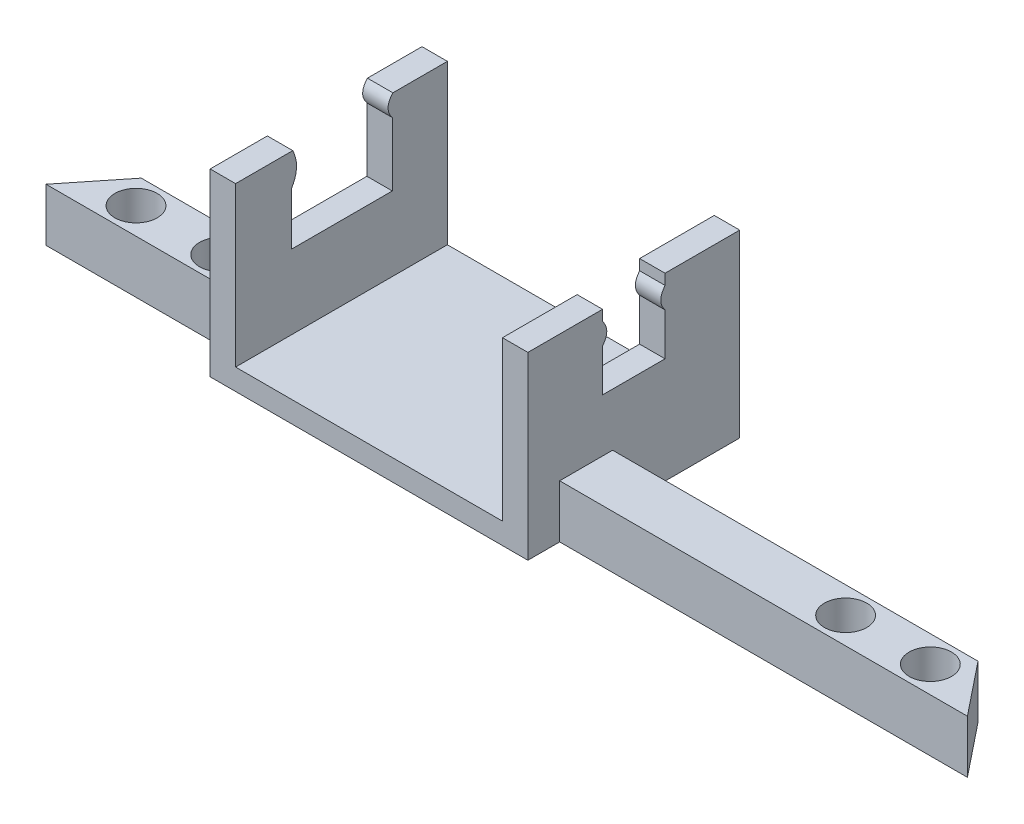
ISO-10303-21;
HEADER;
FILE_DESCRIPTION(('STEP AP214'),'2;1');
FILE_NAME('part.step','',(''),(''),'','','');
FILE_SCHEMA(('AUTOMOTIVE_DESIGN { 1 0 10303 214 1 1 1 1 }'));
ENDSEC;
DATA;
#1=APPLICATION_CONTEXT('core data for automotive mechanical design processes');
#2=APPLICATION_PROTOCOL_DEFINITION('international standard','automotive_design',2000,#1);
#3=PRODUCT_CONTEXT('',#1,'mechanical');
#4=PRODUCT('Part','Part','',(#3));
#5=PRODUCT_RELATED_PRODUCT_CATEGORY('part','',(#4));
#6=PRODUCT_DEFINITION_FORMATION('','',#4);
#7=PRODUCT_DEFINITION_CONTEXT('part definition',#1,'design');
#8=PRODUCT_DEFINITION('design','',#6,#7);
#9=PRODUCT_DEFINITION_SHAPE('','',#8);
#10=(LENGTH_UNIT() NAMED_UNIT(*) SI_UNIT(.MILLI.,.METRE.));
#11=(NAMED_UNIT(*) PLANE_ANGLE_UNIT() SI_UNIT($,.RADIAN.));
#12=(NAMED_UNIT(*) SI_UNIT($,.STERADIAN.) SOLID_ANGLE_UNIT());
#13=UNCERTAINTY_MEASURE_WITH_UNIT(LENGTH_MEASURE(1.E-05),#10,'distance_accuracy_value','');
#14=(GEOMETRIC_REPRESENTATION_CONTEXT(3) GLOBAL_UNCERTAINTY_ASSIGNED_CONTEXT((#13)) GLOBAL_UNIT_ASSIGNED_CONTEXT((#10,
#11,#12)) REPRESENTATION_CONTEXT('',''));
#15=CARTESIAN_POINT('',(0.,0.,0.));
#16=DIRECTION('',(0.,0.,1.));
#17=DIRECTION('',(1.,0.,0.));
#18=AXIS2_PLACEMENT_3D('',#15,#16,#17);
#19=CARTESIAN_POINT('',(-33.5,5.,7.));
#20=DIRECTION('',(0.,0.,1.));
#21=DIRECTION('',(1.,0.,0.));
#22=AXIS2_PLACEMENT_3D('',#19,#20,#21);
#23=PLANE('',#22);
#24=DIRECTION('',(-1.,0.,0.));
#25=VECTOR('',#24,1.);
#26=CARTESIAN_POINT('',(-33.5,5.,7.));
#27=LINE('',#26,#25);
#28=CARTESIAN_POINT('',(53.5,5.,7.00000000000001));
#29=VERTEX_POINT('',#28);
#30=CARTESIAN_POINT('',(15.,5.,7.00000000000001));
#31=VERTEX_POINT('',#30);
#32=EDGE_CURVE('E254',#29,#31,#27,.T.);
#33=ORIENTED_EDGE('',*,*,#32,.T.);
#34=DIRECTION('',(0.,-1.,0.));
#35=VECTOR('',#34,1.);
#36=CARTESIAN_POINT('',(15.,5.,7.));
#37=LINE('',#36,#35);
#38=CARTESIAN_POINT('',(15.,0.,7.00000000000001));
#39=VERTEX_POINT('',#38);
#40=EDGE_CURVE('E323',#31,#39,#37,.T.);
#41=ORIENTED_EDGE('',*,*,#40,.T.);
#42=DIRECTION('',(-1.,0.,0.));
#43=VECTOR('',#42,1.);
#44=CARTESIAN_POINT('',(-33.5,0.,7.));
#45=LINE('',#44,#43);
#46=CARTESIAN_POINT('',(53.5,0.,7.00000000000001));
#47=VERTEX_POINT('',#46);
#48=EDGE_CURVE('E240',#47,#39,#45,.T.);
#49=ORIENTED_EDGE('',*,*,#48,.F.);
#50=DIRECTION('',(0.,-1.,0.));
#51=VECTOR('',#50,1.);
#52=CARTESIAN_POINT('',(53.5,5.,7.00000000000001));
#53=LINE('',#52,#51);
#54=EDGE_CURVE('E246',#29,#47,#53,.T.);
#55=ORIENTED_EDGE('',*,*,#54,.F.);
#56=EDGE_LOOP('',(#33,#41,#49,#55));
#57=FACE_BOUND('',#56,.T.);
#58=ADVANCED_FACE('F35',(#57),#23,.T.);
#59=CARTESIAN_POINT('',(-15.,0.,7.00000000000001));
#60=VERTEX_POINT('',#59);
#61=CARTESIAN_POINT('',(-33.5,0.,7.));
#62=VERTEX_POINT('',#61);
#63=EDGE_CURVE('E234',#60,#62,#45,.T.);
#64=ORIENTED_EDGE('',*,*,#63,.F.);
#65=DIRECTION('',(0.,1.,0.));
#66=VECTOR('',#65,1.);
#67=CARTESIAN_POINT('',(-15.,16.0093585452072,7.));
#68=LINE('',#67,#66);
#69=CARTESIAN_POINT('',(-15.,5.,7.00000000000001));
#70=VERTEX_POINT('',#69);
#71=EDGE_CURVE('E11',#60,#70,#68,.T.);
#72=ORIENTED_EDGE('',*,*,#71,.T.);
#73=CARTESIAN_POINT('',(-33.5,5.,7.));
#74=VERTEX_POINT('',#73);
#75=EDGE_CURVE('E356',#70,#74,#27,.T.);
#76=ORIENTED_EDGE('',*,*,#75,.T.);
#77=DIRECTION('',(0.,-1.,0.));
#78=VECTOR('',#77,1.);
#79=CARTESIAN_POINT('',(-33.5,5.,7.));
#80=LINE('',#79,#78);
#81=EDGE_CURVE('E157',#74,#62,#80,.T.);
#82=ORIENTED_EDGE('',*,*,#81,.T.);
#83=EDGE_LOOP('',(#64,#72,#76,#82));
#84=FACE_BOUND('',#83,.T.);
#85=ADVANCED_FACE('F367',(#84),#23,.T.);
#86=CARTESIAN_POINT('',(-29.5,5.,2.));
#87=DIRECTION('',(0.,0.,-1.));
#88=DIRECTION('',(-1.,0.,0.));
#89=AXIS2_PLACEMENT_3D('',#86,#87,#88);
#90=PLANE('',#89);
#91=DIRECTION('',(1.,0.,0.));
#92=VECTOR('',#91,1.);
#93=CARTESIAN_POINT('',(-29.5,0.,2.));
#94=LINE('',#93,#92);
#95=CARTESIAN_POINT('',(15.,0.,2.));
#96=VERTEX_POINT('',#95);
#97=CARTESIAN_POINT('',(49.5,0.,2.00000000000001));
#98=VERTEX_POINT('',#97);
#99=EDGE_CURVE('E231',#96,#98,#94,.T.);
#100=ORIENTED_EDGE('',*,*,#99,.F.);
#101=DIRECTION('',(0.,1.,0.));
#102=VECTOR('',#101,1.);
#103=CARTESIAN_POINT('',(15.,5.,2.));
#104=LINE('',#103,#102);
#105=CARTESIAN_POINT('',(15.,5.,2.));
#106=VERTEX_POINT('',#105);
#107=EDGE_CURVE('E320',#96,#106,#104,.T.);
#108=ORIENTED_EDGE('',*,*,#107,.T.);
#109=DIRECTION('',(1.,0.,0.));
#110=VECTOR('',#109,1.);
#111=CARTESIAN_POINT('',(-29.5,5.,2.));
#112=LINE('',#111,#110);
#113=CARTESIAN_POINT('',(49.5,5.,2.00000000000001));
#114=VERTEX_POINT('',#113);
#115=EDGE_CURVE('E352',#106,#114,#112,.T.);
#116=ORIENTED_EDGE('',*,*,#115,.T.);
#117=DIRECTION('',(0.,-1.,0.));
#118=VECTOR('',#117,1.);
#119=CARTESIAN_POINT('',(49.5,5.,2.00000000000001));
#120=LINE('',#119,#118);
#121=EDGE_CURVE('E249',#114,#98,#120,.T.);
#122=ORIENTED_EDGE('',*,*,#121,.T.);
#123=EDGE_LOOP('',(#100,#108,#116,#122));
#124=FACE_BOUND('',#123,.T.);
#125=ADVANCED_FACE('F412',(#124),#90,.T.);
#126=DIRECTION('',(0.,-1.,0.));
#127=VECTOR('',#126,1.);
#128=CARTESIAN_POINT('',(-15.,16.0093585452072,2.));
#129=LINE('',#128,#127);
#130=CARTESIAN_POINT('',(-15.,5.,2.));
#131=VERTEX_POINT('',#130);
#132=CARTESIAN_POINT('',(-15.,0.,2.));
#133=VERTEX_POINT('',#132);
#134=EDGE_CURVE('E44',#131,#133,#129,.T.);
#135=ORIENTED_EDGE('',*,*,#134,.T.);
#136=CARTESIAN_POINT('',(-29.5,0.,2.));
#137=VERTEX_POINT('',#136);
#138=EDGE_CURVE('E207',#137,#133,#94,.T.);
#139=ORIENTED_EDGE('',*,*,#138,.F.);
#140=DIRECTION('',(0.,-1.,0.));
#141=VECTOR('',#140,1.);
#142=CARTESIAN_POINT('',(-29.5,5.,2.));
#143=LINE('',#142,#141);
#144=CARTESIAN_POINT('',(-29.5,5.,2.));
#145=VERTEX_POINT('',#144);
#146=EDGE_CURVE('E252',#145,#137,#143,.T.);
#147=ORIENTED_EDGE('',*,*,#146,.F.);
#148=EDGE_CURVE('E210',#145,#131,#112,.T.);
#149=ORIENTED_EDGE('',*,*,#148,.T.);
#150=EDGE_LOOP('',(#135,#139,#147,#149));
#151=FACE_BOUND('',#150,.T.);
#152=ADVANCED_FACE('F203',(#151),#90,.T.);
#153=CARTESIAN_POINT('',(0.,5.,0.));
#154=DIRECTION('',(0.,1.,0.));
#155=DIRECTION('',(0.,0.,1.));
#156=AXIS2_PLACEMENT_3D('',#153,#154,#155);
#157=PLANE('',#156);
#158=CARTESIAN_POINT('',(39.5,5.,4.5));
#159=DIRECTION('',(0.,-1.,0.));
#160=DIRECTION('',(0.,0.,-1.));
#161=AXIS2_PLACEMENT_3D('',#158,#159,#160);
#162=CIRCLE('',#161,2.);
#163=CARTESIAN_POINT('',(39.5,5.,2.5));
#164=VERTEX_POINT('',#163);
#165=EDGE_CURVE('E327',#164,#164,#162,.T.);
#166=ORIENTED_EDGE('',*,*,#165,.T.);
#167=EDGE_LOOP('',(#166));
#168=FACE_BOUND('',#167,.T.);
#169=CARTESIAN_POINT('',(47.5,5.,4.5));
#170=DIRECTION('',(0.,-1.,0.));
#171=DIRECTION('',(0.,0.,-1.));
#172=AXIS2_PLACEMENT_3D('',#169,#170,#171);
#173=CIRCLE('',#172,2.);
#174=CARTESIAN_POINT('',(47.5,5.,2.5));
#175=VERTEX_POINT('',#174);
#176=EDGE_CURVE('E339',#175,#175,#173,.T.);
#177=ORIENTED_EDGE('',*,*,#176,.T.);
#178=EDGE_LOOP('',(#177));
#179=FACE_BOUND('',#178,.T.);
#180=ORIENTED_EDGE('',*,*,#115,.F.);
#181=DIRECTION('',(0.,0.,1.));
#182=VECTOR('',#181,1.);
#183=CARTESIAN_POINT('',(15.,5.,0.));
#184=LINE('',#183,#182);
#185=EDGE_CURVE('E317',#106,#31,#184,.T.);
#186=ORIENTED_EDGE('',*,*,#185,.T.);
#187=ORIENTED_EDGE('',*,*,#32,.F.);
#188=DIRECTION('',(0.624695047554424,0.,0.780868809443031));
#189=VECTOR('',#188,1.);
#190=CARTESIAN_POINT('',(49.5,5.,2.00000000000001));
#191=LINE('',#190,#189);
#192=EDGE_CURVE('E354',#114,#29,#191,.T.);
#193=ORIENTED_EDGE('',*,*,#192,.F.);
#194=EDGE_LOOP('',(#180,#186,#187,#193));
#195=FACE_BOUND('',#194,.T.);
#196=ADVANCED_FACE('F409',(#168,#179,#195),#157,.T.);
#197=CARTESIAN_POINT('',(-12.6,15.0006250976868,-4.80000000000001));
#198=CARTESIAN_POINT('',(-12.6,16.0184045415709,-3.97537194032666));
#199=CARTESIAN_POINT('',(-12.6,17.,-4.85000000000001));
#200=B_SPLINE_CURVE_WITH_KNOTS('',2,(#197,#198,#199),.UNSPECIFIED.,.F.,.F.,(3,3),(0.,1.),.UNSPECIFIED.);
#201=DIRECTION('',(-1.,0.,0.));
#202=VECTOR('',#201,1.);
#203=SURFACE_OF_LINEAR_EXTRUSION('',#200,#202);
#204=CARTESIAN_POINT('',(-15.,15.0006250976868,-4.80000000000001));
#205=CARTESIAN_POINT('',(-15.,16.0184045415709,-3.97537194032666));
#206=CARTESIAN_POINT('',(-15.,17.,-4.85000000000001));
#207=B_SPLINE_CURVE_WITH_KNOTS('',2,(#204,#205,#206),.UNSPECIFIED.,.F.,.F.,(3,3),(0.,1.),.UNSPECIFIED.);
#208=CARTESIAN_POINT('',(-15.,15.0006250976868,-4.80000000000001));
#209=VERTEX_POINT('',#208);
#210=CARTESIAN_POINT('',(-15.,17.,-4.85000000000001));
#211=VERTEX_POINT('',#210);
#212=EDGE_CURVE('E151',#209,#211,#207,.T.);
#213=ORIENTED_EDGE('',*,*,#212,.F.);
#214=DIRECTION('',(-1.,0.,0.));
#215=VECTOR('',#214,1.);
#216=CARTESIAN_POINT('',(-12.6,15.0006250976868,-4.80000000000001));
#217=LINE('',#216,#215);
#218=CARTESIAN_POINT('',(-12.6,15.0006250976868,-4.80000000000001));
#219=VERTEX_POINT('',#218);
#220=EDGE_CURVE('E59',#219,#209,#217,.T.);
#221=ORIENTED_EDGE('',*,*,#220,.F.);
#222=CARTESIAN_POINT('',(-12.6,17.,-4.85000000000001));
#223=VERTEX_POINT('',#222);
#224=EDGE_CURVE('E186',#219,#223,#200,.T.);
#225=ORIENTED_EDGE('',*,*,#224,.T.);
#226=DIRECTION('',(-1.,0.,0.));
#227=VECTOR('',#226,1.);
#228=CARTESIAN_POINT('',(-12.6,17.,-4.85000000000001));
#229=LINE('',#228,#227);
#230=EDGE_CURVE('E98',#223,#211,#229,.T.);
#231=ORIENTED_EDGE('',*,*,#230,.T.);
#232=EDGE_LOOP('',(#213,#221,#225,#231));
#233=FACE_BOUND('',#232,.T.);
#234=ADVANCED_FACE('F37',(#233),#203,.T.);
#235=CARTESIAN_POINT('',(-12.6,15.0006250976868,-4.80000000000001));
#236=DIRECTION('',(0.,0.,1.));
#237=DIRECTION('',(1.,0.,0.));
#238=AXIS2_PLACEMENT_3D('',#235,#236,#237);
#239=PLANE('',#238);
#240=DIRECTION('',(0.,1.,0.));
#241=VECTOR('',#240,1.);
#242=CARTESIAN_POINT('',(-15.,15.0006250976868,-4.80000000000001));
#243=LINE('',#242,#241);
#244=CARTESIAN_POINT('',(-15.,9.00015625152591,-4.80000000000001));
#245=VERTEX_POINT('',#244);
#246=EDGE_CURVE('E183',#245,#209,#243,.T.);
#247=ORIENTED_EDGE('',*,*,#246,.F.);
#248=DIRECTION('',(-1.,0.,0.));
#249=VECTOR('',#248,1.);
#250=CARTESIAN_POINT('',(-12.6,9.00015625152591,-4.80000000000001));
#251=LINE('',#250,#249);
#252=CARTESIAN_POINT('',(-12.6,9.00015625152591,-4.80000000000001));
#253=VERTEX_POINT('',#252);
#254=EDGE_CURVE('E128',#253,#245,#251,.T.);
#255=ORIENTED_EDGE('',*,*,#254,.F.);
#256=DIRECTION('',(0.,1.,0.));
#257=VECTOR('',#256,1.);
#258=CARTESIAN_POINT('',(-12.6,15.0006250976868,-4.80000000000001));
#259=LINE('',#258,#257);
#260=EDGE_CURVE('E138',#253,#219,#259,.T.);
#261=ORIENTED_EDGE('',*,*,#260,.T.);
#262=ORIENTED_EDGE('',*,*,#220,.T.);
#263=EDGE_LOOP('',(#247,#255,#261,#262));
#264=FACE_BOUND('',#263,.T.);
#265=ADVANCED_FACE('F642',(#264),#239,.T.);
#266=CARTESIAN_POINT('',(-12.6,9.00015625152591,-4.80000000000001));
#267=DIRECTION('',(0.,1.,0.));
#268=DIRECTION('',(0.,0.,1.));
#269=AXIS2_PLACEMENT_3D('',#266,#267,#268);
#270=PLANE('',#269);
#271=DIRECTION('',(0.,0.,-1.));
#272=VECTOR('',#271,1.);
#273=CARTESIAN_POINT('',(-15.,9.00015625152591,-4.80000000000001));
#274=LINE('',#273,#272);
#275=CARTESIAN_POINT('',(-15.,9.00015625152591,4.69999999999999));
#276=VERTEX_POINT('',#275);
#277=EDGE_CURVE('E123',#276,#245,#274,.T.);
#278=ORIENTED_EDGE('',*,*,#277,.F.);
#279=DIRECTION('',(-1.,0.,0.));
#280=VECTOR('',#279,1.);
#281=CARTESIAN_POINT('',(-12.6,9.00015625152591,4.69999999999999));
#282=LINE('',#281,#280);
#283=CARTESIAN_POINT('',(-12.6,9.00015625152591,4.69999999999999));
#284=VERTEX_POINT('',#283);
#285=EDGE_CURVE('E117',#284,#276,#282,.T.);
#286=ORIENTED_EDGE('',*,*,#285,.F.);
#287=DIRECTION('',(0.,0.,-1.));
#288=VECTOR('',#287,1.);
#289=CARTESIAN_POINT('',(-12.6,9.00015625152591,-4.80000000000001));
#290=LINE('',#289,#288);
#291=EDGE_CURVE('E120',#284,#253,#290,.T.);
#292=ORIENTED_EDGE('',*,*,#291,.T.);
#293=ORIENTED_EDGE('',*,*,#254,.T.);
#294=EDGE_LOOP('',(#278,#286,#292,#293));
#295=FACE_BOUND('',#294,.T.);
#296=ADVANCED_FACE('F119',(#295),#270,.T.);
#297=CARTESIAN_POINT('',(-12.6,9.00015625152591,4.69999999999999));
#298=DIRECTION('',(0.,0.,-1.));
#299=DIRECTION('',(0.,1.,0.));
#300=AXIS2_PLACEMENT_3D('',#297,#298,#299);
#301=PLANE('',#300);
#302=DIRECTION('',(0.,-1.,0.));
#303=VECTOR('',#302,1.);
#304=CARTESIAN_POINT('',(-15.,9.00015625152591,4.69999999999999));
#305=LINE('',#304,#303);
#306=CARTESIAN_POINT('',(-15.,14.,4.69999999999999));
#307=VERTEX_POINT('',#306);
#308=EDGE_CURVE('E177',#307,#276,#305,.T.);
#309=ORIENTED_EDGE('',*,*,#308,.F.);
#310=DIRECTION('',(-1.,0.,0.));
#311=VECTOR('',#310,1.);
#312=CARTESIAN_POINT('',(-12.6,14.,4.69999999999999));
#313=LINE('',#312,#311);
#314=CARTESIAN_POINT('',(-12.6,14.,4.69999999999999));
#315=VERTEX_POINT('',#314);
#316=EDGE_CURVE('E129',#315,#307,#313,.T.);
#317=ORIENTED_EDGE('',*,*,#316,.F.);
#318=DIRECTION('',(0.,-1.,0.));
#319=VECTOR('',#318,1.);
#320=CARTESIAN_POINT('',(-12.6,9.00015625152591,4.69999999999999));
#321=LINE('',#320,#319);
#322=EDGE_CURVE('E136',#315,#284,#321,.T.);
#323=ORIENTED_EDGE('',*,*,#322,.T.);
#324=ORIENTED_EDGE('',*,*,#285,.T.);
#325=EDGE_LOOP('',(#309,#317,#323,#324));
#326=FACE_BOUND('',#325,.T.);
#327=ADVANCED_FACE('F140',(#326),#301,.T.);
#328=CARTESIAN_POINT('',(-12.6,17.,4.6));
#329=CARTESIAN_POINT('',(-12.6,15.4063054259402,3.84457064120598));
#330=CARTESIAN_POINT('',(-12.6,14.,4.69999999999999));
#331=B_SPLINE_CURVE_WITH_KNOTS('',2,(#328,#329,#330),.UNSPECIFIED.,.F.,.F.,(3,3),(0.,1.),.UNSPECIFIED.);
#332=DIRECTION('',(-1.,0.,0.));
#333=VECTOR('',#332,1.);
#334=SURFACE_OF_LINEAR_EXTRUSION('',#331,#333);
#335=CARTESIAN_POINT('',(-15.,17.,4.6));
#336=CARTESIAN_POINT('',(-15.,15.4063054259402,3.84457064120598));
#337=CARTESIAN_POINT('',(-15.,14.,4.69999999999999));
#338=B_SPLINE_CURVE_WITH_KNOTS('',2,(#335,#336,#337),.UNSPECIFIED.,.F.,.F.,(3,3),(0.,1.),.UNSPECIFIED.);
#339=CARTESIAN_POINT('',(-15.,17.,4.6));
#340=VERTEX_POINT('',#339);
#341=EDGE_CURVE('E172',#340,#307,#338,.T.);
#342=ORIENTED_EDGE('',*,*,#341,.F.);
#343=DIRECTION('',(-1.,0.,0.));
#344=VECTOR('',#343,1.);
#345=CARTESIAN_POINT('',(-12.6,17.,4.6));
#346=LINE('',#345,#344);
#347=CARTESIAN_POINT('',(-12.6,17.,4.6));
#348=VERTEX_POINT('',#347);
#349=EDGE_CURVE('E190',#348,#340,#346,.T.);
#350=ORIENTED_EDGE('',*,*,#349,.F.);
#351=EDGE_CURVE('E141',#348,#315,#331,.T.);
#352=ORIENTED_EDGE('',*,*,#351,.T.);
#353=ORIENTED_EDGE('',*,*,#316,.T.);
#354=EDGE_LOOP('',(#342,#350,#352,#353));
#355=FACE_BOUND('',#354,.T.);
#356=ADVANCED_FACE('F892',(#355),#334,.T.);
#357=CARTESIAN_POINT('',(-12.6,17.,4.6));
#358=DIRECTION('',(0.,1.,0.));
#359=DIRECTION('',(0.,0.,1.));
#360=AXIS2_PLACEMENT_3D('',#357,#358,#359);
#361=PLANE('',#360);
#362=DIRECTION('',(0.,0.,-1.));
#363=VECTOR('',#362,1.);
#364=CARTESIAN_POINT('',(-15.,17.,4.6));
#365=LINE('',#364,#363);
#366=CARTESIAN_POINT('',(-15.,17.,10.));
#367=VERTEX_POINT('',#366);
#368=EDGE_CURVE('E169',#367,#340,#365,.T.);
#369=ORIENTED_EDGE('',*,*,#368,.F.);
#370=DIRECTION('',(-1.,0.,0.));
#371=VECTOR('',#370,1.);
#372=CARTESIAN_POINT('',(-12.6,17.,10.));
#373=LINE('',#372,#371);
#374=CARTESIAN_POINT('',(-12.6,17.,10.));
#375=VERTEX_POINT('',#374);
#376=EDGE_CURVE('E192',#375,#367,#373,.T.);
#377=ORIENTED_EDGE('',*,*,#376,.F.);
#378=DIRECTION('',(0.,0.,-1.));
#379=VECTOR('',#378,1.);
#380=CARTESIAN_POINT('',(-12.6,17.,4.6));
#381=LINE('',#380,#379);
#382=EDGE_CURVE('E143',#375,#348,#381,.T.);
#383=ORIENTED_EDGE('',*,*,#382,.T.);
#384=ORIENTED_EDGE('',*,*,#349,.T.);
#385=EDGE_LOOP('',(#369,#377,#383,#384));
#386=FACE_BOUND('',#385,.T.);
#387=ADVANCED_FACE('F276',(#386),#361,.T.);
#388=CARTESIAN_POINT('',(-12.6,2.,10.));
#389=DIRECTION('',(0.,0.,1.));
#390=DIRECTION('',(0.,-1.,0.));
#391=AXIS2_PLACEMENT_3D('',#388,#389,#390);
#392=PLANE('',#391);
#393=DIRECTION('',(0.,1.,0.));
#394=VECTOR('',#393,1.);
#395=CARTESIAN_POINT('',(-15.,2.,10.));
#396=LINE('',#395,#394);
#397=CARTESIAN_POINT('',(-15.,0.,10.));
#398=VERTEX_POINT('',#397);
#399=EDGE_CURVE('E166',#398,#367,#396,.T.);
#400=ORIENTED_EDGE('',*,*,#399,.F.);
#401=DIRECTION('',(1.,0.,0.));
#402=VECTOR('',#401,1.);
#403=CARTESIAN_POINT('',(-15.,0.,10.));
#404=LINE('',#403,#402);
#405=CARTESIAN_POINT('',(15.,0.,10.));
#406=VERTEX_POINT('',#405);
#407=EDGE_CURVE('E222',#398,#406,#404,.T.);
#408=ORIENTED_EDGE('',*,*,#407,.T.);
#409=DIRECTION('',(0.,-1.,0.));
#410=VECTOR('',#409,1.);
#411=CARTESIAN_POINT('',(15.,2.,10.));
#412=LINE('',#411,#410);
#413=CARTESIAN_POINT('',(15.,17.,10.));
#414=VERTEX_POINT('',#413);
#415=EDGE_CURVE('E297',#414,#406,#412,.T.);
#416=ORIENTED_EDGE('',*,*,#415,.F.);
#417=DIRECTION('',(1.,0.,0.));
#418=VECTOR('',#417,1.);
#419=CARTESIAN_POINT('',(12.6,17.,10.));
#420=LINE('',#419,#418);
#421=CARTESIAN_POINT('',(12.6,17.,10.));
#422=VERTEX_POINT('',#421);
#423=EDGE_CURVE('E453',#422,#414,#420,.T.);
#424=ORIENTED_EDGE('',*,*,#423,.F.);
#425=DIRECTION('',(0.,-1.,0.));
#426=VECTOR('',#425,1.);
#427=CARTESIAN_POINT('',(12.6,2.,10.));
#428=LINE('',#427,#426);
#429=CARTESIAN_POINT('',(12.6,2.,10.));
#430=VERTEX_POINT('',#429);
#431=EDGE_CURVE('E290',#422,#430,#428,.T.);
#432=ORIENTED_EDGE('',*,*,#431,.T.);
#433=DIRECTION('',(1.,0.,0.));
#434=VECTOR('',#433,1.);
#435=CARTESIAN_POINT('',(-15.,2.,10.));
#436=LINE('',#435,#434);
#437=CARTESIAN_POINT('',(-12.6,2.,10.));
#438=VERTEX_POINT('',#437);
#439=EDGE_CURVE('E286',#438,#430,#436,.T.);
#440=ORIENTED_EDGE('',*,*,#439,.F.);
#441=DIRECTION('',(0.,1.,0.));
#442=VECTOR('',#441,1.);
#443=CARTESIAN_POINT('',(-12.6,2.,10.));
#444=LINE('',#443,#442);
#445=EDGE_CURVE('E270',#438,#375,#444,.T.);
#446=ORIENTED_EDGE('',*,*,#445,.T.);
#447=ORIENTED_EDGE('',*,*,#376,.T.);
#448=EDGE_LOOP('',(#400,#408,#416,#424,#432,#440,#446,#447));
#449=FACE_BOUND('',#448,.T.);
#450=ADVANCED_FACE('F283',(#449),#392,.T.);
#451=CARTESIAN_POINT('',(-12.6,2.,-10.));
#452=DIRECTION('',(0.,0.,-1.));
#453=DIRECTION('',(0.,1.,0.));
#454=AXIS2_PLACEMENT_3D('',#451,#452,#453);
#455=PLANE('',#454);
#456=DIRECTION('',(0.,-1.,0.));
#457=VECTOR('',#456,1.);
#458=CARTESIAN_POINT('',(-15.,2.,-10.));
#459=LINE('',#458,#457);
#460=CARTESIAN_POINT('',(-15.,17.,-10.));
#461=VERTEX_POINT('',#460);
#462=CARTESIAN_POINT('',(-15.,0.,-10.));
#463=VERTEX_POINT('',#462);
#464=EDGE_CURVE('E163',#461,#463,#459,.T.);
#465=ORIENTED_EDGE('',*,*,#464,.F.);
#466=DIRECTION('',(-1.,0.,0.));
#467=VECTOR('',#466,1.);
#468=CARTESIAN_POINT('',(-12.6,17.,-10.));
#469=LINE('',#468,#467);
#470=CARTESIAN_POINT('',(-12.6,17.,-10.));
#471=VERTEX_POINT('',#470);
#472=EDGE_CURVE('E194',#471,#461,#469,.T.);
#473=ORIENTED_EDGE('',*,*,#472,.F.);
#474=DIRECTION('',(0.,-1.,0.));
#475=VECTOR('',#474,1.);
#476=CARTESIAN_POINT('',(-12.6,2.,-10.));
#477=LINE('',#476,#475);
#478=CARTESIAN_POINT('',(-12.6,2.,-10.));
#479=VERTEX_POINT('',#478);
#480=EDGE_CURVE('E264',#471,#479,#477,.T.);
#481=ORIENTED_EDGE('',*,*,#480,.T.);
#482=DIRECTION('',(-1.,0.,0.));
#483=VECTOR('',#482,1.);
#484=CARTESIAN_POINT('',(-15.,2.,-10.));
#485=LINE('',#484,#483);
#486=CARTESIAN_POINT('',(12.6,2.,-10.));
#487=VERTEX_POINT('',#486);
#488=EDGE_CURVE('E298',#487,#479,#485,.T.);
#489=ORIENTED_EDGE('',*,*,#488,.F.);
#490=DIRECTION('',(0.,1.,0.));
#491=VECTOR('',#490,1.);
#492=CARTESIAN_POINT('',(12.6,2.,-10.));
#493=LINE('',#492,#491);
#494=CARTESIAN_POINT('',(12.6,17.,-10.));
#495=VERTEX_POINT('',#494);
#496=EDGE_CURVE('E610',#487,#495,#493,.T.);
#497=ORIENTED_EDGE('',*,*,#496,.T.);
#498=DIRECTION('',(1.,0.,0.));
#499=VECTOR('',#498,1.);
#500=CARTESIAN_POINT('',(12.6,17.,-10.));
#501=LINE('',#500,#499);
#502=CARTESIAN_POINT('',(15.,17.,-10.));
#503=VERTEX_POINT('',#502);
#504=EDGE_CURVE('E450',#495,#503,#501,.T.);
#505=ORIENTED_EDGE('',*,*,#504,.T.);
#506=DIRECTION('',(0.,-1.,0.));
#507=VECTOR('',#506,1.);
#508=CARTESIAN_POINT('',(15.,2.,-10.));
#509=LINE('',#508,#507);
#510=CARTESIAN_POINT('',(15.,0.,-10.));
#511=VERTEX_POINT('',#510);
#512=EDGE_CURVE('E301',#503,#511,#509,.T.);
#513=ORIENTED_EDGE('',*,*,#512,.T.);
#514=DIRECTION('',(-1.,0.,0.));
#515=VECTOR('',#514,1.);
#516=CARTESIAN_POINT('',(-15.,0.,-10.));
#517=LINE('',#516,#515);
#518=EDGE_CURVE('E310',#511,#463,#517,.T.);
#519=ORIENTED_EDGE('',*,*,#518,.T.);
#520=EDGE_LOOP('',(#465,#473,#481,#489,#497,#505,#513,#519));
#521=FACE_BOUND('',#520,.T.);
#522=ADVANCED_FACE('F635',(#521),#455,.T.);
#523=CARTESIAN_POINT('',(-12.6,17.,-10.));
#524=DIRECTION('',(0.,1.,0.));
#525=DIRECTION('',(0.,0.,1.));
#526=AXIS2_PLACEMENT_3D('',#523,#524,#525);
#527=PLANE('',#526);
#528=DIRECTION('',(0.,0.,-1.));
#529=VECTOR('',#528,1.);
#530=CARTESIAN_POINT('',(-15.,17.,-10.));
#531=LINE('',#530,#529);
#532=EDGE_CURVE('E156',#211,#461,#531,.T.);
#533=ORIENTED_EDGE('',*,*,#532,.F.);
#534=ORIENTED_EDGE('',*,*,#230,.F.);
#535=DIRECTION('',(0.,0.,-1.));
#536=VECTOR('',#535,1.);
#537=CARTESIAN_POINT('',(-12.6,17.,-10.));
#538=LINE('',#537,#536);
#539=EDGE_CURVE('E259',#223,#471,#538,.T.);
#540=ORIENTED_EDGE('',*,*,#539,.T.);
#541=ORIENTED_EDGE('',*,*,#472,.T.);
#542=EDGE_LOOP('',(#533,#534,#540,#541));
#543=FACE_BOUND('',#542,.T.);
#544=ADVANCED_FACE('F641',(#543),#527,.T.);
#545=CARTESIAN_POINT('',(-12.6,16.0093585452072,-4.40018597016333));
#546=DIRECTION('',(-1.,0.,0.));
#547=DIRECTION('',(0.,0.,1.));
#548=AXIS2_PLACEMENT_3D('',#545,#546,#547);
#549=PLANE('',#548);
#550=ORIENTED_EDGE('',*,*,#445,.F.);
#551=DIRECTION('',(0.,0.,1.));
#552=VECTOR('',#551,1.);
#553=CARTESIAN_POINT('',(-12.6,2.,-10.));
#554=LINE('',#553,#552);
#555=EDGE_CURVE('E267',#479,#438,#554,.T.);
#556=ORIENTED_EDGE('',*,*,#555,.F.);
#557=ORIENTED_EDGE('',*,*,#480,.F.);
#558=ORIENTED_EDGE('',*,*,#539,.F.);
#559=ORIENTED_EDGE('',*,*,#224,.F.);
#560=ORIENTED_EDGE('',*,*,#260,.F.);
#561=ORIENTED_EDGE('',*,*,#291,.F.);
#562=ORIENTED_EDGE('',*,*,#322,.F.);
#563=ORIENTED_EDGE('',*,*,#351,.F.);
#564=ORIENTED_EDGE('',*,*,#382,.F.);
#565=EDGE_LOOP('',(#550,#556,#557,#558,#559,#560,#561,#562,#563,#564));
#566=FACE_BOUND('',#565,.T.);
#567=ADVANCED_FACE('F134',(#566),#549,.F.);
#568=CARTESIAN_POINT('',(-15.,16.0093585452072,-4.40018597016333));
#569=DIRECTION('',(-1.,0.,0.));
#570=DIRECTION('',(0.,0.,1.));
#571=AXIS2_PLACEMENT_3D('',#568,#569,#570);
#572=PLANE('',#571);
#573=ORIENTED_EDGE('',*,*,#71,.F.);
#574=DIRECTION('',(0.,0.,1.));
#575=VECTOR('',#574,1.);
#576=CARTESIAN_POINT('',(-15.,0.,-10.));
#577=LINE('',#576,#575);
#578=EDGE_CURVE('E223',#60,#398,#577,.T.);
#579=ORIENTED_EDGE('',*,*,#578,.T.);
#580=ORIENTED_EDGE('',*,*,#399,.T.);
#581=ORIENTED_EDGE('',*,*,#368,.T.);
#582=ORIENTED_EDGE('',*,*,#341,.T.);
#583=ORIENTED_EDGE('',*,*,#308,.T.);
#584=ORIENTED_EDGE('',*,*,#277,.T.);
#585=ORIENTED_EDGE('',*,*,#246,.T.);
#586=ORIENTED_EDGE('',*,*,#212,.T.);
#587=ORIENTED_EDGE('',*,*,#532,.T.);
#588=ORIENTED_EDGE('',*,*,#464,.T.);
#589=EDGE_CURVE('E215',#463,#133,#577,.T.);
#590=ORIENTED_EDGE('',*,*,#589,.T.);
#591=ORIENTED_EDGE('',*,*,#134,.F.);
#592=DIRECTION('',(0.,0.,-1.));
#593=VECTOR('',#592,1.);
#594=CARTESIAN_POINT('',(-15.,5.,-4.40018597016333));
#595=LINE('',#594,#593);
#596=EDGE_CURVE('E51',#70,#131,#595,.T.);
#597=ORIENTED_EDGE('',*,*,#596,.F.);
#598=EDGE_LOOP('',(#573,#579,#580,#581,#582,#583,#584,#585,#586,#587,#588,#590,#591,#597));
#599=FACE_BOUND('',#598,.T.);
#600=ADVANCED_FACE('F216',(#599),#572,.T.);
#601=CARTESIAN_POINT('',(-29.5,5.,2.));
#602=DIRECTION('',(-0.780868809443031,0.,-0.624695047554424));
#603=DIRECTION('',(-0.624695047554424,0.,0.780868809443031));
#604=AXIS2_PLACEMENT_3D('',#601,#602,#603);
#605=PLANE('',#604);
#606=DIRECTION('',(0.624695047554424,0.,-0.780868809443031));
#607=VECTOR('',#606,1.);
#608=CARTESIAN_POINT('',(-29.5,0.,2.));
#609=LINE('',#608,#607);
#610=EDGE_CURVE('E229',#62,#137,#609,.T.);
#611=ORIENTED_EDGE('',*,*,#610,.F.);
#612=ORIENTED_EDGE('',*,*,#81,.F.);
#613=DIRECTION('',(0.624695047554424,0.,-0.780868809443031));
#614=VECTOR('',#613,1.);
#615=CARTESIAN_POINT('',(-29.5,5.,2.));
#616=LINE('',#615,#614);
#617=EDGE_CURVE('E243',#74,#145,#616,.T.);
#618=ORIENTED_EDGE('',*,*,#617,.T.);
#619=ORIENTED_EDGE('',*,*,#146,.T.);
#620=EDGE_LOOP('',(#611,#612,#618,#619));
#621=FACE_BOUND('',#620,.T.);
#622=ADVANCED_FACE('F374',(#621),#605,.T.);
#623=CARTESIAN_POINT('',(49.5,5.,2.00000000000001));
#624=DIRECTION('',(0.780868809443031,0.,-0.624695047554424));
#625=DIRECTION('',(-0.624695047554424,0.,-0.780868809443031));
#626=AXIS2_PLACEMENT_3D('',#623,#624,#625);
#627=PLANE('',#626);
#628=DIRECTION('',(0.624695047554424,0.,0.780868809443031));
#629=VECTOR('',#628,1.);
#630=CARTESIAN_POINT('',(49.5,0.,2.00000000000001));
#631=LINE('',#630,#629);
#632=EDGE_CURVE('E230',#98,#47,#631,.T.);
#633=ORIENTED_EDGE('',*,*,#632,.F.);
#634=ORIENTED_EDGE('',*,*,#121,.F.);
#635=ORIENTED_EDGE('',*,*,#192,.T.);
#636=ORIENTED_EDGE('',*,*,#54,.T.);
#637=EDGE_LOOP('',(#633,#634,#635,#636));
#638=FACE_BOUND('',#637,.T.);
#639=ADVANCED_FACE('F390',(#638),#627,.T.);
#640=CARTESIAN_POINT('',(-19.5,5.,4.5));
#641=DIRECTION('',(0.,-1.,0.));
#642=DIRECTION('',(0.,0.,-1.));
#643=AXIS2_PLACEMENT_3D('',#640,#641,#642);
#644=CIRCLE('',#643,2.);
#645=CARTESIAN_POINT('',(-19.5,5.,2.5));
#646=VERTEX_POINT('',#645);
#647=EDGE_CURVE('E333',#646,#646,#644,.T.);
#648=ORIENTED_EDGE('',*,*,#647,.T.);
#649=EDGE_LOOP('',(#648));
#650=FACE_BOUND('',#649,.T.);
#651=CARTESIAN_POINT('',(-27.5,5.,4.5));
#652=DIRECTION('',(0.,-1.,0.));
#653=DIRECTION('',(0.,0.,-1.));
#654=AXIS2_PLACEMENT_3D('',#651,#652,#653);
#655=CIRCLE('',#654,2.);
#656=CARTESIAN_POINT('',(-27.5,5.,2.5));
#657=VERTEX_POINT('',#656);
#658=EDGE_CURVE('E345',#657,#657,#655,.T.);
#659=ORIENTED_EDGE('',*,*,#658,.T.);
#660=EDGE_LOOP('',(#659));
#661=FACE_BOUND('',#660,.T.);
#662=ORIENTED_EDGE('',*,*,#75,.F.);
#663=ORIENTED_EDGE('',*,*,#596,.T.);
#664=ORIENTED_EDGE('',*,*,#148,.F.);
#665=ORIENTED_EDGE('',*,*,#617,.F.);
#666=EDGE_LOOP('',(#662,#663,#664,#665));
#667=FACE_BOUND('',#666,.T.);
#668=ADVANCED_FACE('F376',(#650,#661,#667),#157,.T.);
#669=CARTESIAN_POINT('',(0.,0.,0.));
#670=DIRECTION('',(0.,1.,0.));
#671=DIRECTION('',(0.,0.,1.));
#672=AXIS2_PLACEMENT_3D('',#669,#670,#671);
#673=PLANE('',#672);
#674=ORIENTED_EDGE('',*,*,#138,.T.);
#675=ORIENTED_EDGE('',*,*,#589,.F.);
#676=ORIENTED_EDGE('',*,*,#518,.F.);
#677=DIRECTION('',(0.,0.,-1.));
#678=VECTOR('',#677,1.);
#679=CARTESIAN_POINT('',(15.,0.,-10.));
#680=LINE('',#679,#678);
#681=EDGE_CURVE('E311',#96,#511,#680,.T.);
#682=ORIENTED_EDGE('',*,*,#681,.F.);
#683=ORIENTED_EDGE('',*,*,#99,.T.);
#684=ORIENTED_EDGE('',*,*,#632,.T.);
#685=ORIENTED_EDGE('',*,*,#48,.T.);
#686=EDGE_CURVE('E307',#406,#39,#680,.T.);
#687=ORIENTED_EDGE('',*,*,#686,.F.);
#688=ORIENTED_EDGE('',*,*,#407,.F.);
#689=ORIENTED_EDGE('',*,*,#578,.F.);
#690=ORIENTED_EDGE('',*,*,#63,.T.);
#691=ORIENTED_EDGE('',*,*,#610,.T.);
#692=EDGE_LOOP('',(#674,#675,#676,#682,#683,#684,#685,#687,#688,#689,#690,#691));
#693=FACE_BOUND('',#692,.T.);
#694=CARTESIAN_POINT('',(-27.5,0.,4.5));
#695=DIRECTION('',(0.,-1.,0.));
#696=DIRECTION('',(0.,0.,-1.));
#697=AXIS2_PLACEMENT_3D('',#694,#695,#696);
#698=CIRCLE('',#697,2.);
#699=CARTESIAN_POINT('',(-27.5,0.,2.5));
#700=VERTEX_POINT('',#699);
#701=EDGE_CURVE('E342',#700,#700,#698,.T.);
#702=ORIENTED_EDGE('',*,*,#701,.F.);
#703=EDGE_LOOP('',(#702));
#704=FACE_BOUND('',#703,.T.);
#705=CARTESIAN_POINT('',(-19.5,0.,4.5));
#706=DIRECTION('',(0.,-1.,0.));
#707=DIRECTION('',(0.,0.,-1.));
#708=AXIS2_PLACEMENT_3D('',#705,#706,#707);
#709=CIRCLE('',#708,2.);
#710=CARTESIAN_POINT('',(-19.5,0.,2.5));
#711=VERTEX_POINT('',#710);
#712=EDGE_CURVE('E330',#711,#711,#709,.T.);
#713=ORIENTED_EDGE('',*,*,#712,.F.);
#714=EDGE_LOOP('',(#713));
#715=FACE_BOUND('',#714,.T.);
#716=CARTESIAN_POINT('',(47.5,0.,4.5));
#717=DIRECTION('',(0.,-1.,0.));
#718=DIRECTION('',(0.,0.,-1.));
#719=AXIS2_PLACEMENT_3D('',#716,#717,#718);
#720=CIRCLE('',#719,2.);
#721=CARTESIAN_POINT('',(47.5,0.,2.5));
#722=VERTEX_POINT('',#721);
#723=EDGE_CURVE('E336',#722,#722,#720,.T.);
#724=ORIENTED_EDGE('',*,*,#723,.F.);
#725=EDGE_LOOP('',(#724));
#726=FACE_BOUND('',#725,.T.);
#727=CARTESIAN_POINT('',(39.5,0.,4.5));
#728=DIRECTION('',(0.,-1.,0.));
#729=DIRECTION('',(0.,0.,-1.));
#730=AXIS2_PLACEMENT_3D('',#727,#728,#729);
#731=CIRCLE('',#730,2.);
#732=CARTESIAN_POINT('',(39.5,0.,2.5));
#733=VERTEX_POINT('',#732);
#734=EDGE_CURVE('E326',#733,#733,#731,.T.);
#735=ORIENTED_EDGE('',*,*,#734,.F.);
#736=EDGE_LOOP('',(#735));
#737=FACE_BOUND('',#736,.T.);
#738=ADVANCED_FACE('F225',(#693,#704,#715,#726,#737),#673,.F.);
#739=CARTESIAN_POINT('',(-27.5,5.,4.5));
#740=DIRECTION('',(0.,-1.,0.));
#741=DIRECTION('',(0.,0.,-1.));
#742=AXIS2_PLACEMENT_3D('',#739,#740,#741);
#743=CYLINDRICAL_SURFACE('',#742,2.);
#744=ORIENTED_EDGE('',*,*,#658,.F.);
#745=EDGE_LOOP('',(#744));
#746=FACE_BOUND('',#745,.T.);
#747=ORIENTED_EDGE('',*,*,#701,.T.);
#748=EDGE_LOOP('',(#747));
#749=FACE_BOUND('',#748,.T.);
#750=ADVANCED_FACE('F694',(#746,#749),#743,.F.);
#751=CARTESIAN_POINT('',(47.5,5.,4.5));
#752=DIRECTION('',(0.,-1.,0.));
#753=DIRECTION('',(0.,0.,-1.));
#754=AXIS2_PLACEMENT_3D('',#751,#752,#753);
#755=CYLINDRICAL_SURFACE('',#754,2.);
#756=ORIENTED_EDGE('',*,*,#176,.F.);
#757=EDGE_LOOP('',(#756));
#758=FACE_BOUND('',#757,.T.);
#759=ORIENTED_EDGE('',*,*,#723,.T.);
#760=EDGE_LOOP('',(#759));
#761=FACE_BOUND('',#760,.T.);
#762=ADVANCED_FACE('F700',(#758,#761),#755,.F.);
#763=CARTESIAN_POINT('',(-19.5,5.,4.5));
#764=DIRECTION('',(0.,-1.,0.));
#765=DIRECTION('',(0.,0.,-1.));
#766=AXIS2_PLACEMENT_3D('',#763,#764,#765);
#767=CYLINDRICAL_SURFACE('',#766,2.);
#768=ORIENTED_EDGE('',*,*,#647,.F.);
#769=EDGE_LOOP('',(#768));
#770=FACE_BOUND('',#769,.T.);
#771=ORIENTED_EDGE('',*,*,#712,.T.);
#772=EDGE_LOOP('',(#771));
#773=FACE_BOUND('',#772,.T.);
#774=ADVANCED_FACE('F708',(#770,#773),#767,.F.);
#775=CARTESIAN_POINT('',(39.5,5.,4.5));
#776=DIRECTION('',(0.,-1.,0.));
#777=DIRECTION('',(0.,0.,-1.));
#778=AXIS2_PLACEMENT_3D('',#775,#776,#777);
#779=CYLINDRICAL_SURFACE('',#778,2.);
#780=ORIENTED_EDGE('',*,*,#165,.F.);
#781=EDGE_LOOP('',(#780));
#782=FACE_BOUND('',#781,.T.);
#783=ORIENTED_EDGE('',*,*,#734,.T.);
#784=EDGE_LOOP('',(#783));
#785=FACE_BOUND('',#784,.T.);
#786=ADVANCED_FACE('F716',(#782,#785),#779,.F.);
#787=CARTESIAN_POINT('',(0.,2.,0.));
#788=DIRECTION('',(0.,1.,0.));
#789=DIRECTION('',(0.,0.,1.));
#790=AXIS2_PLACEMENT_3D('',#787,#788,#789);
#791=PLANE('',#790);
#792=ORIENTED_EDGE('',*,*,#555,.T.);
#793=ORIENTED_EDGE('',*,*,#439,.T.);
#794=DIRECTION('',(0.,0.,-1.));
#795=VECTOR('',#794,1.);
#796=CARTESIAN_POINT('',(12.6,2.,10.));
#797=LINE('',#796,#795);
#798=EDGE_CURVE('E608',#430,#487,#797,.T.);
#799=ORIENTED_EDGE('',*,*,#798,.T.);
#800=ORIENTED_EDGE('',*,*,#488,.T.);
#801=EDGE_LOOP('',(#792,#793,#799,#800));
#802=FACE_BOUND('',#801,.T.);
#803=ADVANCED_FACE('F639',(#802),#791,.T.);
#804=CARTESIAN_POINT('',(15.,2.,-10.));
#805=DIRECTION('',(-1.,0.,0.));
#806=DIRECTION('',(0.,0.,1.));
#807=AXIS2_PLACEMENT_3D('',#804,#805,#806);
#808=PLANE('',#807);
#809=ORIENTED_EDGE('',*,*,#40,.F.);
#810=ORIENTED_EDGE('',*,*,#185,.F.);
#811=ORIENTED_EDGE('',*,*,#107,.F.);
#812=ORIENTED_EDGE('',*,*,#681,.T.);
#813=ORIENTED_EDGE('',*,*,#512,.F.);
#814=DIRECTION('',(0.,0.,1.));
#815=VECTOR('',#814,1.);
#816=CARTESIAN_POINT('',(15.,17.,-2.95));
#817=LINE('',#816,#815);
#818=CARTESIAN_POINT('',(15.,17.,-2.95));
#819=VERTEX_POINT('',#818);
#820=EDGE_CURVE('E583',#503,#819,#817,.T.);
#821=ORIENTED_EDGE('',*,*,#820,.T.);
#822=DIRECTION('',(0.,-1.,0.));
#823=VECTOR('',#822,1.);
#824=CARTESIAN_POINT('',(15.,16.,-2.95));
#825=LINE('',#824,#823);
#826=CARTESIAN_POINT('',(15.,16.,-2.95));
#827=VERTEX_POINT('',#826);
#828=EDGE_CURVE('E585',#819,#827,#825,.T.);
#829=ORIENTED_EDGE('',*,*,#828,.T.);
#830=CARTESIAN_POINT('',(15.,16.,-2.95));
#831=CARTESIAN_POINT('',(15.,15.,-2.15));
#832=CARTESIAN_POINT('',(15.,14.,-2.95));
#833=B_SPLINE_CURVE_WITH_KNOTS('',2,(#830,#831,#832),.UNSPECIFIED.,.F.,.F.,(3,3),(0.,1.),.UNSPECIFIED.);
#834=CARTESIAN_POINT('',(15.,14.,-2.95));
#835=VERTEX_POINT('',#834);
#836=EDGE_CURVE('E551',#827,#835,#833,.T.);
#837=ORIENTED_EDGE('',*,*,#836,.T.);
#838=DIRECTION('',(0.,-1.,0.));
#839=VECTOR('',#838,1.);
#840=CARTESIAN_POINT('',(15.,10.,-2.95));
#841=LINE('',#840,#839);
#842=CARTESIAN_POINT('',(15.,10.,-2.95));
#843=VERTEX_POINT('',#842);
#844=EDGE_CURVE('E544',#835,#843,#841,.T.);
#845=ORIENTED_EDGE('',*,*,#844,.T.);
#846=DIRECTION('',(0.,0.,1.));
#847=VECTOR('',#846,1.);
#848=CARTESIAN_POINT('',(15.,10.,2.95));
#849=LINE('',#848,#847);
#850=CARTESIAN_POINT('',(15.,10.,2.95));
#851=VERTEX_POINT('',#850);
#852=EDGE_CURVE('E596',#843,#851,#849,.T.);
#853=ORIENTED_EDGE('',*,*,#852,.T.);
#854=DIRECTION('',(0.,1.,0.));
#855=VECTOR('',#854,1.);
#856=CARTESIAN_POINT('',(15.,14.,2.95));
#857=LINE('',#856,#855);
#858=CARTESIAN_POINT('',(15.,14.,2.95));
#859=VERTEX_POINT('',#858);
#860=EDGE_CURVE('E598',#851,#859,#857,.T.);
#861=ORIENTED_EDGE('',*,*,#860,.T.);
#862=CARTESIAN_POINT('',(15.,14.,2.95));
#863=CARTESIAN_POINT('',(15.,15.,2.15));
#864=CARTESIAN_POINT('',(15.,16.,2.95));
#865=B_SPLINE_CURVE_WITH_KNOTS('',2,(#862,#863,#864),.UNSPECIFIED.,.F.,.F.,(3,3),(0.,1.),.UNSPECIFIED.);
#866=CARTESIAN_POINT('',(15.,16.,2.95));
#867=VERTEX_POINT('',#866);
#868=EDGE_CURVE('E431',#859,#867,#865,.T.);
#869=ORIENTED_EDGE('',*,*,#868,.T.);
#870=DIRECTION('',(0.,1.,0.));
#871=VECTOR('',#870,1.);
#872=CARTESIAN_POINT('',(15.,17.,2.95));
#873=LINE('',#872,#871);
#874=CARTESIAN_POINT('',(15.,17.,2.95));
#875=VERTEX_POINT('',#874);
#876=EDGE_CURVE('E476',#867,#875,#873,.T.);
#877=ORIENTED_EDGE('',*,*,#876,.T.);
#878=DIRECTION('',(0.,0.,1.));
#879=VECTOR('',#878,1.);
#880=CARTESIAN_POINT('',(15.,17.,10.));
#881=LINE('',#880,#879);
#882=EDGE_CURVE('E578',#875,#414,#881,.T.);
#883=ORIENTED_EDGE('',*,*,#882,.T.);
#884=ORIENTED_EDGE('',*,*,#415,.T.);
#885=ORIENTED_EDGE('',*,*,#686,.T.);
#886=EDGE_LOOP('',(#809,#810,#811,#812,#813,#821,#829,#837,#845,#853,#861,#869,#877,#883,#884,#885));
#887=FACE_BOUND('',#886,.T.);
#888=ADVANCED_FACE('F403',(#887),#808,.F.);
#889=CARTESIAN_POINT('',(12.6,17.,2.95));
#890=DIRECTION('',(0.,0.,-1.));
#891=DIRECTION('',(0.,1.,0.));
#892=AXIS2_PLACEMENT_3D('',#889,#890,#891);
#893=PLANE('',#892);
#894=ORIENTED_EDGE('',*,*,#876,.F.);
#895=DIRECTION('',(1.,0.,0.));
#896=VECTOR('',#895,1.);
#897=CARTESIAN_POINT('',(12.6,16.,2.95));
#898=LINE('',#897,#896);
#899=CARTESIAN_POINT('',(12.6,16.,2.95));
#900=VERTEX_POINT('',#899);
#901=EDGE_CURVE('E417',#900,#867,#898,.T.);
#902=ORIENTED_EDGE('',*,*,#901,.F.);
#903=DIRECTION('',(0.,1.,0.));
#904=VECTOR('',#903,1.);
#905=CARTESIAN_POINT('',(12.6,17.,2.95));
#906=LINE('',#905,#904);
#907=CARTESIAN_POINT('',(12.6,17.,2.95));
#908=VERTEX_POINT('',#907);
#909=EDGE_CURVE('E600',#900,#908,#906,.T.);
#910=ORIENTED_EDGE('',*,*,#909,.T.);
#911=DIRECTION('',(1.,0.,0.));
#912=VECTOR('',#911,1.);
#913=CARTESIAN_POINT('',(12.6,17.,2.95));
#914=LINE('',#913,#912);
#915=EDGE_CURVE('E455',#908,#875,#914,.T.);
#916=ORIENTED_EDGE('',*,*,#915,.T.);
#917=EDGE_LOOP('',(#894,#902,#910,#916));
#918=FACE_BOUND('',#917,.T.);
#919=ADVANCED_FACE('F487',(#918),#893,.T.);
#920=CARTESIAN_POINT('',(12.6,14.,2.95));
#921=CARTESIAN_POINT('',(12.6,15.,2.15));
#922=CARTESIAN_POINT('',(12.6,16.,2.95));
#923=B_SPLINE_CURVE_WITH_KNOTS('',2,(#920,#921,#922),.UNSPECIFIED.,.F.,.F.,(3,3),(0.,1.),.UNSPECIFIED.);
#924=DIRECTION('',(1.,0.,0.));
#925=VECTOR('',#924,1.);
#926=SURFACE_OF_LINEAR_EXTRUSION('',#923,#925);
#927=ORIENTED_EDGE('',*,*,#868,.F.);
#928=DIRECTION('',(1.,0.,0.));
#929=VECTOR('',#928,1.);
#930=CARTESIAN_POINT('',(12.6,14.,2.95));
#931=LINE('',#930,#929);
#932=CARTESIAN_POINT('',(12.6,14.,2.95));
#933=VERTEX_POINT('',#932);
#934=EDGE_CURVE('E419',#933,#859,#931,.T.);
#935=ORIENTED_EDGE('',*,*,#934,.F.);
#936=EDGE_CURVE('E457',#933,#900,#923,.T.);
#937=ORIENTED_EDGE('',*,*,#936,.T.);
#938=ORIENTED_EDGE('',*,*,#901,.T.);
#939=EDGE_LOOP('',(#927,#935,#937,#938));
#940=FACE_BOUND('',#939,.T.);
#941=ADVANCED_FACE('F482',(#940),#926,.T.);
#942=CARTESIAN_POINT('',(12.6,14.,2.95));
#943=DIRECTION('',(0.,0.,-1.));
#944=DIRECTION('',(0.,1.,0.));
#945=AXIS2_PLACEMENT_3D('',#942,#943,#944);
#946=PLANE('',#945);
#947=ORIENTED_EDGE('',*,*,#860,.F.);
#948=DIRECTION('',(1.,0.,0.));
#949=VECTOR('',#948,1.);
#950=CARTESIAN_POINT('',(12.6,10.,2.95));
#951=LINE('',#950,#949);
#952=CARTESIAN_POINT('',(12.6,10.,2.95));
#953=VERTEX_POINT('',#952);
#954=EDGE_CURVE('E428',#953,#851,#951,.T.);
#955=ORIENTED_EDGE('',*,*,#954,.F.);
#956=DIRECTION('',(0.,1.,0.));
#957=VECTOR('',#956,1.);
#958=CARTESIAN_POINT('',(12.6,14.,2.95));
#959=LINE('',#958,#957);
#960=EDGE_CURVE('E463',#953,#933,#959,.T.);
#961=ORIENTED_EDGE('',*,*,#960,.T.);
#962=ORIENTED_EDGE('',*,*,#934,.T.);
#963=EDGE_LOOP('',(#947,#955,#961,#962));
#964=FACE_BOUND('',#963,.T.);
#965=ADVANCED_FACE('F486',(#964),#946,.T.);
#966=CARTESIAN_POINT('',(12.6,10.,2.95));
#967=DIRECTION('',(0.,1.,0.));
#968=DIRECTION('',(0.,0.,1.));
#969=AXIS2_PLACEMENT_3D('',#966,#967,#968);
#970=PLANE('',#969);
#971=ORIENTED_EDGE('',*,*,#852,.F.);
#972=DIRECTION('',(1.,0.,0.));
#973=VECTOR('',#972,1.);
#974=CARTESIAN_POINT('',(12.6,10.,-2.95));
#975=LINE('',#974,#973);
#976=CARTESIAN_POINT('',(12.6,10.,-2.95));
#977=VERTEX_POINT('',#976);
#978=EDGE_CURVE('E438',#977,#843,#975,.T.);
#979=ORIENTED_EDGE('',*,*,#978,.F.);
#980=DIRECTION('',(0.,0.,1.));
#981=VECTOR('',#980,1.);
#982=CARTESIAN_POINT('',(12.6,10.,2.95));
#983=LINE('',#982,#981);
#984=EDGE_CURVE('E469',#977,#953,#983,.T.);
#985=ORIENTED_EDGE('',*,*,#984,.T.);
#986=ORIENTED_EDGE('',*,*,#954,.T.);
#987=EDGE_LOOP('',(#971,#979,#985,#986));
#988=FACE_BOUND('',#987,.T.);
#989=ADVANCED_FACE('F491',(#988),#970,.T.);
#990=CARTESIAN_POINT('',(12.6,10.,-2.95));
#991=DIRECTION('',(0.,0.,1.));
#992=DIRECTION('',(0.,-1.,0.));
#993=AXIS2_PLACEMENT_3D('',#990,#991,#992);
#994=PLANE('',#993);
#995=ORIENTED_EDGE('',*,*,#844,.F.);
#996=DIRECTION('',(1.,0.,0.));
#997=VECTOR('',#996,1.);
#998=CARTESIAN_POINT('',(12.6,14.,-2.95));
#999=LINE('',#998,#997);
#1000=CARTESIAN_POINT('',(12.6,14.,-2.95));
#1001=VERTEX_POINT('',#1000);
#1002=EDGE_CURVE('E441',#1001,#835,#999,.T.);
#1003=ORIENTED_EDGE('',*,*,#1002,.F.);
#1004=DIRECTION('',(0.,-1.,0.));
#1005=VECTOR('',#1004,1.);
#1006=CARTESIAN_POINT('',(12.6,10.,-2.95));
#1007=LINE('',#1006,#1005);
#1008=EDGE_CURVE('E514',#1001,#977,#1007,.T.);
#1009=ORIENTED_EDGE('',*,*,#1008,.T.);
#1010=ORIENTED_EDGE('',*,*,#978,.T.);
#1011=EDGE_LOOP('',(#995,#1003,#1009,#1010));
#1012=FACE_BOUND('',#1011,.T.);
#1013=ADVANCED_FACE('F495',(#1012),#994,.T.);
#1014=CARTESIAN_POINT('',(12.6,16.,-2.95));
#1015=CARTESIAN_POINT('',(12.6,15.,-2.15));
#1016=CARTESIAN_POINT('',(12.6,14.,-2.95));
#1017=B_SPLINE_CURVE_WITH_KNOTS('',2,(#1014,#1015,#1016),.UNSPECIFIED.,.F.,.F.,(3,3),(0.,1.),.UNSPECIFIED.);
#1018=DIRECTION('',(1.,0.,0.));
#1019=VECTOR('',#1018,1.);
#1020=SURFACE_OF_LINEAR_EXTRUSION('',#1017,#1019);
#1021=ORIENTED_EDGE('',*,*,#836,.F.);
#1022=DIRECTION('',(1.,0.,0.));
#1023=VECTOR('',#1022,1.);
#1024=CARTESIAN_POINT('',(12.6,16.,-2.95));
#1025=LINE('',#1024,#1023);
#1026=CARTESIAN_POINT('',(12.6,16.,-2.95));
#1027=VERTEX_POINT('',#1026);
#1028=EDGE_CURVE('E444',#1027,#827,#1025,.T.);
#1029=ORIENTED_EDGE('',*,*,#1028,.F.);
#1030=EDGE_CURVE('E507',#1027,#1001,#1017,.T.);
#1031=ORIENTED_EDGE('',*,*,#1030,.T.);
#1032=ORIENTED_EDGE('',*,*,#1002,.T.);
#1033=EDGE_LOOP('',(#1021,#1029,#1031,#1032));
#1034=FACE_BOUND('',#1033,.T.);
#1035=ADVANCED_FACE('F499',(#1034),#1020,.T.);
#1036=CARTESIAN_POINT('',(12.6,16.,-2.95));
#1037=DIRECTION('',(0.,0.,1.));
#1038=DIRECTION('',(0.,-1.,0.));
#1039=AXIS2_PLACEMENT_3D('',#1036,#1037,#1038);
#1040=PLANE('',#1039);
#1041=ORIENTED_EDGE('',*,*,#828,.F.);
#1042=DIRECTION('',(1.,0.,0.));
#1043=VECTOR('',#1042,1.);
#1044=CARTESIAN_POINT('',(12.6,17.,-2.95));
#1045=LINE('',#1044,#1043);
#1046=CARTESIAN_POINT('',(12.6,17.,-2.95));
#1047=VERTEX_POINT('',#1046);
#1048=EDGE_CURVE('E447',#1047,#819,#1045,.T.);
#1049=ORIENTED_EDGE('',*,*,#1048,.F.);
#1050=DIRECTION('',(0.,-1.,0.));
#1051=VECTOR('',#1050,1.);
#1052=CARTESIAN_POINT('',(12.6,16.,-2.95));
#1053=LINE('',#1052,#1051);
#1054=EDGE_CURVE('E515',#1047,#1027,#1053,.T.);
#1055=ORIENTED_EDGE('',*,*,#1054,.T.);
#1056=ORIENTED_EDGE('',*,*,#1028,.T.);
#1057=EDGE_LOOP('',(#1041,#1049,#1055,#1056));
#1058=FACE_BOUND('',#1057,.T.);
#1059=ADVANCED_FACE('F504',(#1058),#1040,.T.);
#1060=CARTESIAN_POINT('',(12.6,17.,-2.95));
#1061=DIRECTION('',(0.,1.,0.));
#1062=DIRECTION('',(0.,0.,1.));
#1063=AXIS2_PLACEMENT_3D('',#1060,#1061,#1062);
#1064=PLANE('',#1063);
#1065=ORIENTED_EDGE('',*,*,#820,.F.);
#1066=ORIENTED_EDGE('',*,*,#504,.F.);
#1067=DIRECTION('',(0.,0.,1.));
#1068=VECTOR('',#1067,1.);
#1069=CARTESIAN_POINT('',(12.6,17.,-2.95));
#1070=LINE('',#1069,#1068);
#1071=EDGE_CURVE('E612',#495,#1047,#1070,.T.);
#1072=ORIENTED_EDGE('',*,*,#1071,.T.);
#1073=ORIENTED_EDGE('',*,*,#1048,.T.);
#1074=EDGE_LOOP('',(#1065,#1066,#1072,#1073));
#1075=FACE_BOUND('',#1074,.T.);
#1076=ADVANCED_FACE('F633',(#1075),#1064,.T.);
#1077=CARTESIAN_POINT('',(12.6,17.,10.));
#1078=DIRECTION('',(0.,1.,0.));
#1079=DIRECTION('',(0.,0.,1.));
#1080=AXIS2_PLACEMENT_3D('',#1077,#1078,#1079);
#1081=PLANE('',#1080);
#1082=ORIENTED_EDGE('',*,*,#882,.F.);
#1083=ORIENTED_EDGE('',*,*,#915,.F.);
#1084=DIRECTION('',(0.,0.,1.));
#1085=VECTOR('',#1084,1.);
#1086=CARTESIAN_POINT('',(12.6,17.,10.));
#1087=LINE('',#1086,#1085);
#1088=EDGE_CURVE('E601',#908,#422,#1087,.T.);
#1089=ORIENTED_EDGE('',*,*,#1088,.T.);
#1090=ORIENTED_EDGE('',*,*,#423,.T.);
#1091=EDGE_LOOP('',(#1082,#1083,#1089,#1090));
#1092=FACE_BOUND('',#1091,.T.);
#1093=ADVANCED_FACE('F768',(#1092),#1081,.T.);
#1094=CARTESIAN_POINT('',(12.6,15.,2.55));
#1095=DIRECTION('',(1.,0.,0.));
#1096=DIRECTION('',(0.,0.,-1.));
#1097=AXIS2_PLACEMENT_3D('',#1094,#1095,#1096);
#1098=PLANE('',#1097);
#1099=ORIENTED_EDGE('',*,*,#496,.F.);
#1100=ORIENTED_EDGE('',*,*,#798,.F.);
#1101=ORIENTED_EDGE('',*,*,#431,.F.);
#1102=ORIENTED_EDGE('',*,*,#1088,.F.);
#1103=ORIENTED_EDGE('',*,*,#909,.F.);
#1104=ORIENTED_EDGE('',*,*,#936,.F.);
#1105=ORIENTED_EDGE('',*,*,#960,.F.);
#1106=ORIENTED_EDGE('',*,*,#984,.F.);
#1107=ORIENTED_EDGE('',*,*,#1008,.F.);
#1108=ORIENTED_EDGE('',*,*,#1030,.F.);
#1109=ORIENTED_EDGE('',*,*,#1054,.F.);
#1110=ORIENTED_EDGE('',*,*,#1071,.F.);
#1111=EDGE_LOOP('',(#1099,#1100,#1101,#1102,#1103,#1104,#1105,#1106,#1107,#1108,#1109,#1110));
#1112=FACE_BOUND('',#1111,.T.);
#1113=ADVANCED_FACE('F488',(#1112),#1098,.F.);
#1114=CLOSED_SHELL('',(#58,#85,#125,#152,#196,#234,#265,#296,#327,#356,#387,#450,#522,#544,#567,
#600,#622,#639,#668,#738,#750,#762,#774,#786,#803,#888,#919,#941,#965,#989,#1013,#1035,#1059,
#1076,#1093,#1113));
#1115=MANIFOLD_SOLID_BREP('B2',#1114);
#1116=ADVANCED_BREP_SHAPE_REPRESENTATION('',(#18,#1115),#14);
#1117=SHAPE_DEFINITION_REPRESENTATION(#9,#1116);
ENDSEC;
END-ISO-10303-21;
